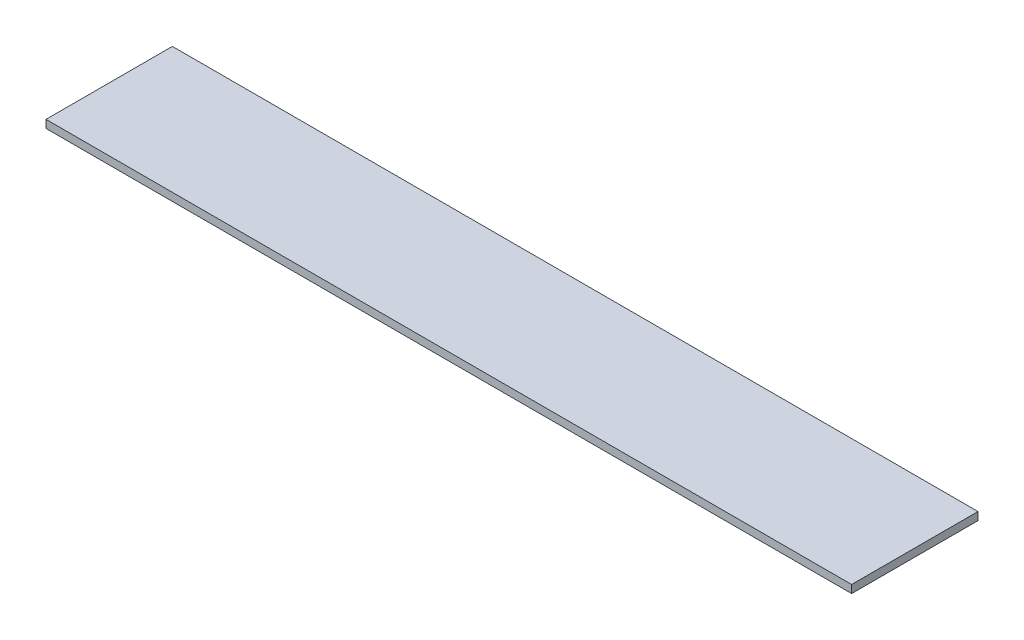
from build123d import *

# Parameters (mm, degrees)
SKETCH1_W           = 647.7
SKETCH1_H           = 101.6
BOSS_EXTRUDE1_DEPTH = 6.35


with BuildPart() as part:
    # Sketch1 → Boss-Extrude1 (new body)
    with BuildSketch(Plane(origin=(0, 0, 0), x_dir=(1, 0, 0), z_dir=(0, 1, 0))):
        Rectangle(SKETCH1_W, SKETCH1_H)
    extrude(amount=BOSS_EXTRUDE1_DEPTH)


solid = part.part
